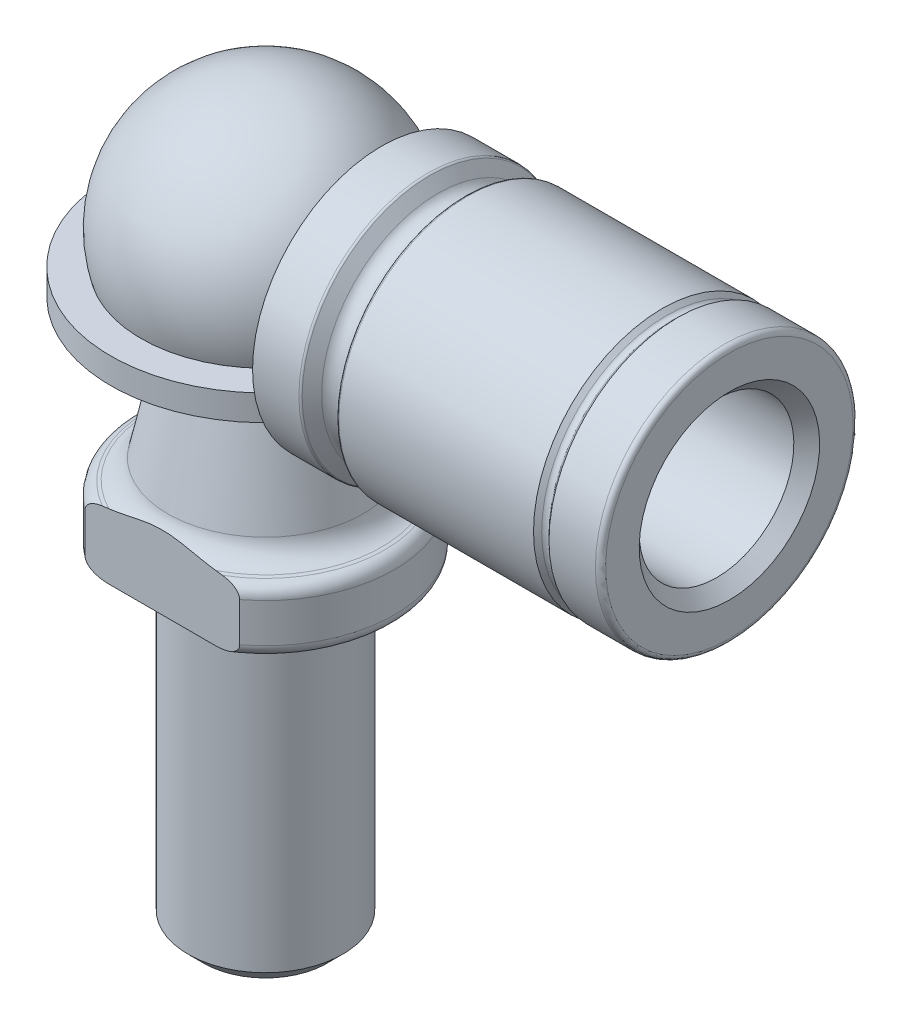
from build123d import *

# Parameters (mm, degrees)
ESQUISSE7_W             = 23.124431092
ESQUISSE7_H             = 10.0672646
ESQUISSE7_W_2           = 24.411224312
ESQUISSE7_H_2           = 5.109326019
ENL_V_MAT_EXTRU_2_DEPTH = 5.5


with BuildPart() as part:
    # Esquisse1 → R_volution1 (revolve)
    with BuildSketch(Plane.XY, mode=Mode.PRIVATE) as r_volution1_sk:
        with BuildLine():
            Line((0, 0), (1.5011107, 2.6))
            Line((1.5011107, 2.6), (3.5011107, 2.6))
            Line((3.5011107, 2.6), (3.9011107, 3))
            Line((3.9011107, 3), (11.4011107, 3))
            Line((11.4011107, 3), (11.9011107, 3.5))
            Line((11.9011107, 3.5), (11.9011107, 4.8))
            ThreePointArc((11.9011107, 4.8), (11.842532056, 4.941421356), (11.7011107, 5))
            Line((11.7011107, 5), (9.9011107, 5))
            Line((9.9011107, 5), (9.742532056, 4.841421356))
            ThreePointArc((9.742532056, 4.841421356), (9.6011107, 4.782842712), (9.459689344, 4.841421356))
            Line((9.459689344, 4.841421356), (9.3011107, 5))
            Line((9.3011107, 5), (1.752094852, 5))
            ThreePointArc((1.752094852, 5), (1.702094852, 4.98660254), (1.665492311, 4.95))
            Line((1.665492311, 4.95), (1.434552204, 4.55))
            ThreePointArc((1.434552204, 4.55), (1.023349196, 4.300475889), (0.59196348, 4.513211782))
            Line((0.59196348, 4.513211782), (0.280969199, 4.957357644))
            ThreePointArc((0.280969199, 4.957357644), (0.245228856, 4.988701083), (0.199053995, 5))
            Line((0.199053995, 5), (-1.5988893, 5))
            Line((-1.5988893, 5), (-1.5988893, 2.179449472))
            ThreePointArc((-1.5988893, 2.179449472), (-1.225492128, 1.118033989), (-1.0988893, 0))
            Line((-1.0988893, 0), (0, 0))
        make_face()
    revolve(r_volution1_sk.sketch.rotate(Axis((-6.0988893, 0, 0), (1, 0, 0)), 180), axis=Axis((-6.0988893, 0, 0), (1, 0, 0)))


with BuildPart() as body_2:
    # Esquisse5 → R_volution3 (revolve)
    with BuildSketch(Plane.XY):
        with BuildLine():
            Line((-6.0988893, 5), (-6.0988893, -23.5))
            Line((-6.0988893, -23.5), (-8.4988893, -23.5))
            Line((-8.4988893, -23.5), (-9.0988893, -22.9))
            Line((-9.0988893, -22.9), (-9.0988893, -15.6))
            Line((-9.0988893, -15.6), (-9.0988893, -11))
            Line((-9.0988893, -11), (-10.5988893, -11))
            ThreePointArc((-10.5988893, -11), (-10.952442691, -10.853553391), (-11.0988893, -10.5))
            Line((-11.0988893, -10.5), (-11.0988893, -8.983663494))
            ThreePointArc((-11.0988893, -8.983663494), (-10.99556597, -8.679282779), (-10.728298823, -8.500700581))
            Line((-10.728298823, -8.500700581), (-10.606832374, -8.468153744))
            ThreePointArc((-10.606832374, -8.468153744), (-10.140277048, -8.190582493), (-9.887503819, -7.710139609))
            Line((-9.887503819, -7.710139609), (-9.163096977, -4.302073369))
            ThreePointArc((-9.163096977, -4.302073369), (-9.17906519, -4.036342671), (-9.329145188, -3.816470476))
            ThreePointArc((-9.329145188, -3.816470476), (-10.793692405, 1.720123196), (-6.0988893, 5))
        make_face()
    revolve(axis=Axis((-6.0988893, 5, 0), (0, -1, 0)))

    # Esquisse7 → Enl_v. mat.-Extru.2 (cut)
    with BuildSketch(Plane.XZ.offset(11)):
        with Locations((-9.402279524, 9.0336323)):
            Rectangle(ESQUISSE7_W, ESQUISSE7_H)
        with Locations((-10.045676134, -6.55466301)):
            Rectangle(ESQUISSE7_W_2, ESQUISSE7_H_2)
    extrude(amount=-ENL_V_MAT_EXTRU_2_DEPTH, mode=Mode.SUBTRACT)


with BuildPart() as body_3:
    # Esquisse11 → R_volution5 (revolve)
    with BuildSketch(Plane.XY, mode=Mode.PRIVATE) as r_volution5_sk:
        with BuildLine():
            Line((-0.0988893, -1.3), (-1.270846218, -1.3))
            ThreePointArc((-1.270846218, -1.3), (-1.384065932, -1.66446406), (-1.524754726, -2.019230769))
            ThreePointArc((-1.524754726, -2.019230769), (-1.509351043, -2.209192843), (-1.341789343, -2.3))
            Line((-1.341789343, -2.3), (-0.0988893, -2.3))
            Line((-0.0988893, -2.3), (-0.0988893, -1.3))
        make_face()
    revolve(r_volution5_sk.sketch.rotate(Axis((-6.0988893, -11, 0), (0, -1, 0)), 180), axis=Axis((-6.0988893, -11, 0), (0, -1, 0)))


solid = Compound([part.part, body_2.part, body_3.part])
